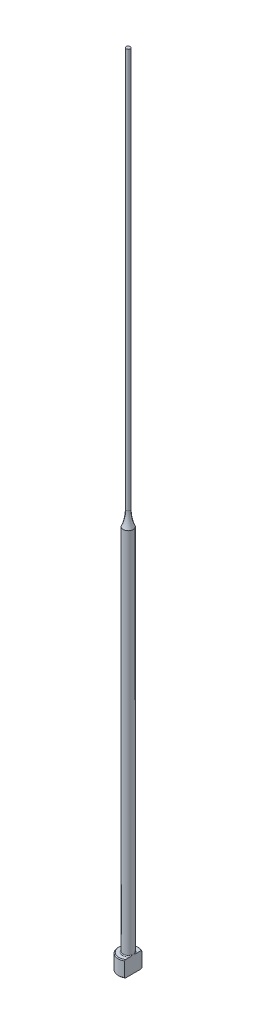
from build123d import *
from build123d.topology import SkipClean

# Parameters (mm, degrees)
CHAMFER1_SIZE    = 0.2
FILLET1_R        = 0.2
KEYED_HEAD_DEPTH = 201.031247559


with BuildPart() as part:
    # Sketch1 → Revolve1 (revolve)
    with BuildSketch(Plane.XY, mode=Mode.PRIVATE) as revolve1_sk:
        with BuildLine():
            Line((0, 0), (-2.5, 0))
            Line((-2.5, 0), (-2.5, 4))
            Line((-2.5, 4), (-1.25, 4))
            Line((-1.25, 4), (-1.25, 96.200328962))
            ThreePointArc((-1.25, 96.200328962), (-0.689291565, 98.063508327), (-0.5, 100))
            Line((-0.5, 100), (-0.5, 200))
            Line((-0.5, 200), (0, 200))
            Line((0, 200), (0, 0))
        make_face()
    revolve(revolve1_sk.sketch.rotate(Axis((0, 259.958771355, 0), (0, -1, 0)), 270), axis=Axis((0, 259.958771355, 0), (0, -1, 0)))

    # Chamfer1
    chamfer1_edges = [part.edges().sort_by_distance(p)[0] for p in [
        (0, 0, -2.5),
        (0, 4, -2.5),
    ]]
    chamfer(chamfer1_edges, length=CHAMFER1_SIZE)

    # Fillet1
    fillet1_edges = [part.edges().sort_by_distance(p)[0] for p in [
        (0, 4, -1.25),
    ]]
    fillet(fillet1_edges, radius=FILLET1_R)

    # Sketch2 → Keyed Head (cut, through all)
    with SkipClean():  # the faces are left unmerged after this step: merging them gives an invalid solid
        with BuildSketch(Plane(origin=(0, 0, 0), x_dir=(1, 0, 0), z_dir=(0, 1, 0))):
            with BuildLine():
                Line((1.25, -2.165063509), (1.25, 2.165063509))
                ThreePointArc((1.25, 2.165063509), (2.5, 0), (1.25, -2.165063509))
            make_face()
        extrude(amount=KEYED_HEAD_DEPTH, mode=Mode.SUBTRACT)


solid = part.part
